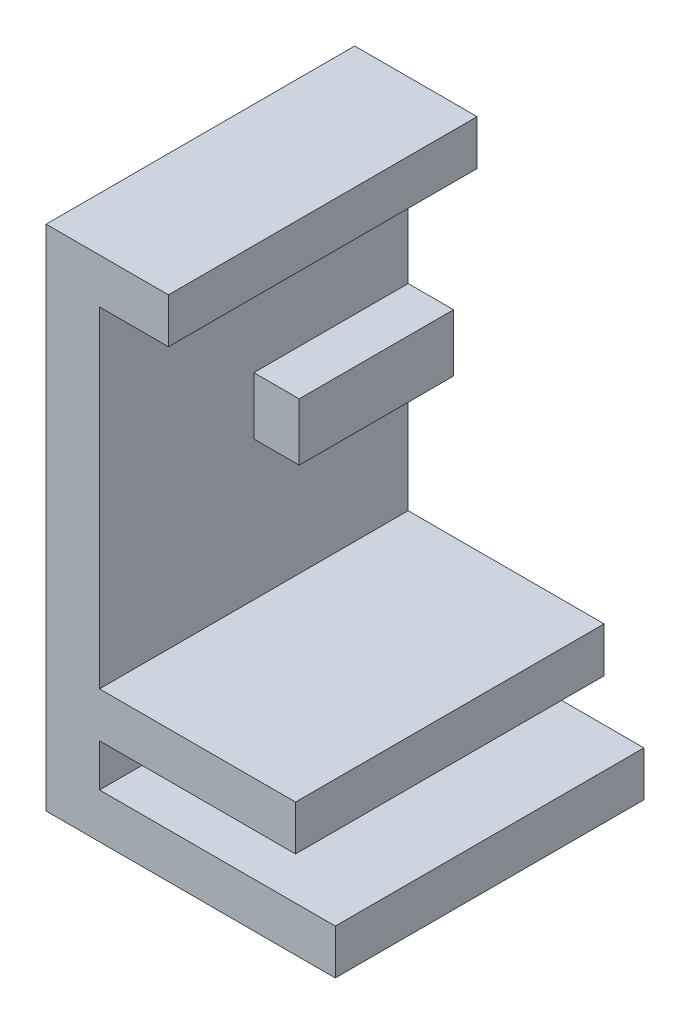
ISO-10303-21;
HEADER;
FILE_DESCRIPTION(('STEP AP214'),'2;1');
FILE_NAME('part.step','',(''),(''),'','','');
FILE_SCHEMA(('AUTOMOTIVE_DESIGN { 1 0 10303 214 1 1 1 1 }'));
ENDSEC;
DATA;
#1=APPLICATION_CONTEXT('core data for automotive mechanical design processes');
#2=APPLICATION_PROTOCOL_DEFINITION('international standard','automotive_design',2000,#1);
#3=PRODUCT_CONTEXT('',#1,'mechanical');
#4=PRODUCT('Part','Part','',(#3));
#5=PRODUCT_RELATED_PRODUCT_CATEGORY('part','',(#4));
#6=PRODUCT_DEFINITION_FORMATION('','',#4);
#7=PRODUCT_DEFINITION_CONTEXT('part definition',#1,'design');
#8=PRODUCT_DEFINITION('design','',#6,#7);
#9=PRODUCT_DEFINITION_SHAPE('','',#8);
#10=(LENGTH_UNIT() NAMED_UNIT(*) SI_UNIT(.MILLI.,.METRE.));
#11=(NAMED_UNIT(*) PLANE_ANGLE_UNIT() SI_UNIT($,.RADIAN.));
#12=(NAMED_UNIT(*) SI_UNIT($,.STERADIAN.) SOLID_ANGLE_UNIT());
#13=UNCERTAINTY_MEASURE_WITH_UNIT(LENGTH_MEASURE(1.E-05),#10,'distance_accuracy_value','');
#14=(GEOMETRIC_REPRESENTATION_CONTEXT(3) GLOBAL_UNCERTAINTY_ASSIGNED_CONTEXT((#13)) GLOBAL_UNIT_ASSIGNED_CONTEXT((#10,
#11,#12)) REPRESENTATION_CONTEXT('',''));
#15=CARTESIAN_POINT('',(0.,0.,0.));
#16=DIRECTION('',(0.,0.,1.));
#17=DIRECTION('',(1.,0.,0.));
#18=AXIS2_PLACEMENT_3D('',#15,#16,#17);
#19=CARTESIAN_POINT('',(139.766211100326,-45.7667519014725,47.5));
#20=DIRECTION('',(0.,-1.,0.));
#21=DIRECTION('',(0.,0.,-1.));
#22=AXIS2_PLACEMENT_3D('',#19,#20,#21);
#23=PLANE('',#22);
#24=DIRECTION('',(-1.,0.,0.));
#25=VECTOR('',#24,1.);
#26=CARTESIAN_POINT('',(139.766211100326,-45.7667519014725,-47.5));
#27=LINE('',#26,#25);
#28=CARTESIAN_POINT('',(139.766211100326,-45.7667519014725,-47.5));
#29=VERTEX_POINT('',#28);
#30=CARTESIAN_POINT('',(79.4274220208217,-45.7667519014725,-47.5));
#31=VERTEX_POINT('',#30);
#32=EDGE_CURVE('E160',#29,#31,#27,.T.);
#33=ORIENTED_EDGE('',*,*,#32,.T.);
#34=DIRECTION('',(0.,0.,-1.));
#35=VECTOR('',#34,1.);
#36=CARTESIAN_POINT('',(79.4274220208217,-45.7667519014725,47.5));
#37=LINE('',#36,#35);
#38=CARTESIAN_POINT('',(79.4274220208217,-45.7667519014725,47.5));
#39=VERTEX_POINT('',#38);
#40=EDGE_CURVE('E11',#39,#31,#37,.T.);
#41=ORIENTED_EDGE('',*,*,#40,.F.);
#42=DIRECTION('',(-1.,0.,0.));
#43=VECTOR('',#42,1.);
#44=CARTESIAN_POINT('',(139.766211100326,-45.7667519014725,47.5));
#45=LINE('',#44,#43);
#46=CARTESIAN_POINT('',(139.766211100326,-45.7667519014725,47.5));
#47=VERTEX_POINT('',#46);
#48=EDGE_CURVE('E224',#47,#39,#45,.T.);
#49=ORIENTED_EDGE('',*,*,#48,.F.);
#50=DIRECTION('',(0.,0.,-1.));
#51=VECTOR('',#50,1.);
#52=CARTESIAN_POINT('',(139.766211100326,-45.7667519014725,47.5));
#53=LINE('',#52,#51);
#54=EDGE_CURVE('E201',#47,#29,#53,.T.);
#55=ORIENTED_EDGE('',*,*,#54,.T.);
#56=EDGE_LOOP('',(#33,#41,#49,#55));
#57=FACE_BOUND('',#56,.T.);
#58=ADVANCED_FACE('F31',(#57),#23,.F.);
#59=CARTESIAN_POINT('',(79.4274220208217,-2.89157012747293,47.5));
#60=DIRECTION('',(0.,1.,0.));
#61=DIRECTION('',(0.,0.,1.));
#62=AXIS2_PLACEMENT_3D('',#59,#60,#61);
#63=PLANE('',#62);
#64=DIRECTION('',(0.,0.,-1.));
#65=VECTOR('',#64,1.);
#66=CARTESIAN_POINT('',(93.3999473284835,-2.89157012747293,47.5));
#67=LINE('',#66,#65);
#68=CARTESIAN_POINT('',(93.3999473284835,-2.89157012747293,0.));
#69=VERTEX_POINT('',#68);
#70=CARTESIAN_POINT('',(93.3999473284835,-2.89157012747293,-47.5));
#71=VERTEX_POINT('',#70);
#72=EDGE_CURVE('E159',#69,#71,#67,.T.);
#73=ORIENTED_EDGE('',*,*,#72,.F.);
#74=DIRECTION('',(1.,0.,0.));
#75=VECTOR('',#74,1.);
#76=CARTESIAN_POINT('',(79.4274220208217,-2.89157012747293,0.));
#77=LINE('',#76,#75);
#78=CARTESIAN_POINT('',(79.4274220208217,-2.89157012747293,0.));
#79=VERTEX_POINT('',#78);
#80=EDGE_CURVE('E145',#79,#69,#77,.T.);
#81=ORIENTED_EDGE('',*,*,#80,.F.);
#82=DIRECTION('',(0.,0.,-1.));
#83=VECTOR('',#82,1.);
#84=CARTESIAN_POINT('',(79.4274220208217,-2.89157012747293,47.5));
#85=LINE('',#84,#83);
#86=CARTESIAN_POINT('',(79.4274220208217,-2.89157012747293,-47.5));
#87=VERTEX_POINT('',#86);
#88=EDGE_CURVE('E38',#79,#87,#85,.T.);
#89=ORIENTED_EDGE('',*,*,#88,.T.);
#90=DIRECTION('',(1.,0.,0.));
#91=VECTOR('',#90,1.);
#92=CARTESIAN_POINT('',(79.4274220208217,-2.89157012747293,-47.5));
#93=LINE('',#92,#91);
#94=EDGE_CURVE('E254',#87,#71,#93,.T.);
#95=ORIENTED_EDGE('',*,*,#94,.T.);
#96=EDGE_LOOP('',(#73,#81,#89,#95));
#97=FACE_BOUND('',#96,.T.);
#98=ADVANCED_FACE('F156',(#97),#63,.F.);
#99=CARTESIAN_POINT('',(93.3999473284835,-2.89157012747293,47.5));
#100=DIRECTION('',(-1.,0.,0.));
#101=DIRECTION('',(0.,0.,1.));
#102=AXIS2_PLACEMENT_3D('',#99,#100,#101);
#103=PLANE('',#102);
#104=DIRECTION('',(0.,0.,-1.));
#105=VECTOR('',#104,1.);
#106=CARTESIAN_POINT('',(93.3999473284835,14.7914505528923,47.5));
#107=LINE('',#106,#105);
#108=CARTESIAN_POINT('',(93.3999473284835,14.7914505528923,0.));
#109=VERTEX_POINT('',#108);
#110=CARTESIAN_POINT('',(93.3999473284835,14.7914505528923,-47.5));
#111=VERTEX_POINT('',#110);
#112=EDGE_CURVE('E165',#109,#111,#107,.T.);
#113=ORIENTED_EDGE('',*,*,#112,.F.);
#114=DIRECTION('',(0.,1.,0.));
#115=VECTOR('',#114,1.);
#116=CARTESIAN_POINT('',(93.3999473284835,-86.5522105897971,0.));
#117=LINE('',#116,#115);
#118=EDGE_CURVE('E152',#69,#109,#117,.T.);
#119=ORIENTED_EDGE('',*,*,#118,.F.);
#120=ORIENTED_EDGE('',*,*,#72,.T.);
#121=DIRECTION('',(0.,1.,0.));
#122=VECTOR('',#121,1.);
#123=CARTESIAN_POINT('',(93.3999473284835,-2.89157012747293,-47.5));
#124=LINE('',#123,#122);
#125=EDGE_CURVE('E251',#71,#111,#124,.T.);
#126=ORIENTED_EDGE('',*,*,#125,.T.);
#127=EDGE_LOOP('',(#113,#119,#120,#126));
#128=FACE_BOUND('',#127,.T.);
#129=ADVANCED_FACE('F264',(#128),#103,.F.);
#130=CARTESIAN_POINT('',(93.3999473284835,14.7914505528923,47.5));
#131=DIRECTION('',(0.,-1.,0.));
#132=DIRECTION('',(0.,0.,-1.));
#133=AXIS2_PLACEMENT_3D('',#130,#131,#132);
#134=PLANE('',#133);
#135=DIRECTION('',(0.,0.,-1.));
#136=VECTOR('',#135,1.);
#137=CARTESIAN_POINT('',(79.4274220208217,14.7914505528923,47.5));
#138=LINE('',#137,#136);
#139=CARTESIAN_POINT('',(79.4274220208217,14.7914505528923,0.));
#140=VERTEX_POINT('',#139);
#141=CARTESIAN_POINT('',(79.4274220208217,14.7914505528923,-47.5));
#142=VERTEX_POINT('',#141);
#143=EDGE_CURVE('E169',#140,#142,#138,.T.);
#144=ORIENTED_EDGE('',*,*,#143,.F.);
#145=DIRECTION('',(-1.,0.,0.));
#146=VECTOR('',#145,1.);
#147=CARTESIAN_POINT('',(79.4274220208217,14.7914505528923,0.));
#148=LINE('',#147,#146);
#149=EDGE_CURVE('E148',#109,#140,#148,.T.);
#150=ORIENTED_EDGE('',*,*,#149,.F.);
#151=ORIENTED_EDGE('',*,*,#112,.T.);
#152=DIRECTION('',(-1.,0.,0.));
#153=VECTOR('',#152,1.);
#154=CARTESIAN_POINT('',(93.3999473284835,14.7914505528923,-47.5));
#155=LINE('',#154,#153);
#156=EDGE_CURVE('E248',#111,#142,#155,.T.);
#157=ORIENTED_EDGE('',*,*,#156,.T.);
#158=EDGE_LOOP('',(#144,#150,#151,#157));
#159=FACE_BOUND('',#158,.T.);
#160=ADVANCED_FACE('F263',(#159),#134,.F.);
#161=CARTESIAN_POINT('',(79.4274220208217,14.7914505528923,47.5));
#162=DIRECTION('',(-1.,0.,0.));
#163=DIRECTION('',(0.,0.,1.));
#164=AXIS2_PLACEMENT_3D('',#161,#162,#163);
#165=PLANE('',#164);
#166=DIRECTION('',(0.,1.,0.));
#167=VECTOR('',#166,1.);
#168=CARTESIAN_POINT('',(79.4274220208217,14.7914505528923,-47.5));
#169=LINE('',#168,#167);
#170=CARTESIAN_POINT('',(79.4274220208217,56.0485401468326,-47.5));
#171=VERTEX_POINT('',#170);
#172=EDGE_CURVE('E246',#142,#171,#169,.T.);
#173=ORIENTED_EDGE('',*,*,#172,.T.);
#174=DIRECTION('',(0.,0.,-1.));
#175=VECTOR('',#174,1.);
#176=CARTESIAN_POINT('',(79.4274220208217,56.0485401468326,47.5));
#177=LINE('',#176,#175);
#178=CARTESIAN_POINT('',(79.4274220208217,56.0485401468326,47.5));
#179=VERTEX_POINT('',#178);
#180=EDGE_CURVE('E171',#179,#171,#177,.T.);
#181=ORIENTED_EDGE('',*,*,#180,.F.);
#182=DIRECTION('',(0.,1.,0.));
#183=VECTOR('',#182,1.);
#184=CARTESIAN_POINT('',(79.4274220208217,-45.7667519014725,47.5));
#185=LINE('',#184,#183);
#186=EDGE_CURVE('E222',#39,#179,#185,.T.);
#187=ORIENTED_EDGE('',*,*,#186,.F.);
#188=ORIENTED_EDGE('',*,*,#40,.T.);
#189=DIRECTION('',(0.,1.,0.));
#190=VECTOR('',#189,1.);
#191=CARTESIAN_POINT('',(79.4274220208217,-45.7667519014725,-47.5));
#192=LINE('',#191,#190);
#193=EDGE_CURVE('E163',#31,#87,#192,.T.);
#194=ORIENTED_EDGE('',*,*,#193,.T.);
#195=ORIENTED_EDGE('',*,*,#88,.F.);
#196=DIRECTION('',(0.,1.,0.));
#197=VECTOR('',#196,1.);
#198=CARTESIAN_POINT('',(79.4274220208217,-86.5522105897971,0.));
#199=LINE('',#198,#197);
#200=EDGE_CURVE('E142',#79,#140,#199,.T.);
#201=ORIENTED_EDGE('',*,*,#200,.T.);
#202=ORIENTED_EDGE('',*,*,#143,.T.);
#203=EDGE_LOOP('',(#173,#181,#187,#188,#194,#195,#201,#202));
#204=FACE_BOUND('',#203,.T.);
#205=ADVANCED_FACE('F162',(#204),#165,.F.);
#206=CARTESIAN_POINT('',(79.4274220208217,56.0485401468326,47.5));
#207=DIRECTION('',(0.,1.,0.));
#208=DIRECTION('',(0.,0.,1.));
#209=AXIS2_PLACEMENT_3D('',#206,#207,#208);
#210=PLANE('',#209);
#211=DIRECTION('',(1.,0.,0.));
#212=VECTOR('',#211,1.);
#213=CARTESIAN_POINT('',(79.4274220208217,56.0485401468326,-47.5));
#214=LINE('',#213,#212);
#215=CARTESIAN_POINT('',(100.6545595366,56.0485401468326,-47.5));
#216=VERTEX_POINT('',#215);
#217=EDGE_CURVE('E244',#171,#216,#214,.T.);
#218=ORIENTED_EDGE('',*,*,#217,.T.);
#219=DIRECTION('',(0.,0.,-1.));
#220=VECTOR('',#219,1.);
#221=CARTESIAN_POINT('',(100.6545595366,56.0485401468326,47.5));
#222=LINE('',#221,#220);
#223=CARTESIAN_POINT('',(100.6545595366,56.0485401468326,47.5));
#224=VERTEX_POINT('',#223);
#225=EDGE_CURVE('E174',#224,#216,#222,.T.);
#226=ORIENTED_EDGE('',*,*,#225,.F.);
#227=DIRECTION('',(1.,0.,0.));
#228=VECTOR('',#227,1.);
#229=CARTESIAN_POINT('',(79.4274220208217,56.0485401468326,47.5));
#230=LINE('',#229,#228);
#231=EDGE_CURVE('E220',#179,#224,#230,.T.);
#232=ORIENTED_EDGE('',*,*,#231,.F.);
#233=ORIENTED_EDGE('',*,*,#180,.T.);
#234=EDGE_LOOP('',(#218,#226,#232,#233));
#235=FACE_BOUND('',#234,.T.);
#236=ADVANCED_FACE('F276',(#235),#210,.F.);
#237=CARTESIAN_POINT('',(100.6545595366,56.0485401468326,47.5));
#238=DIRECTION('',(-1.,0.,0.));
#239=DIRECTION('',(0.,0.,1.));
#240=AXIS2_PLACEMENT_3D('',#237,#238,#239);
#241=PLANE('',#240);
#242=DIRECTION('',(0.,1.,0.));
#243=VECTOR('',#242,1.);
#244=CARTESIAN_POINT('',(100.6545595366,56.0485401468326,-47.5));
#245=LINE('',#244,#243);
#246=CARTESIAN_POINT('',(100.6545595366,69.8894366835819,-47.5));
#247=VERTEX_POINT('',#246);
#248=EDGE_CURVE('E242',#216,#247,#245,.T.);
#249=ORIENTED_EDGE('',*,*,#248,.T.);
#250=DIRECTION('',(0.,0.,-1.));
#251=VECTOR('',#250,1.);
#252=CARTESIAN_POINT('',(100.6545595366,69.8894366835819,47.5));
#253=LINE('',#252,#251);
#254=CARTESIAN_POINT('',(100.6545595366,69.8894366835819,47.5));
#255=VERTEX_POINT('',#254);
#256=EDGE_CURVE('E177',#255,#247,#253,.T.);
#257=ORIENTED_EDGE('',*,*,#256,.F.);
#258=DIRECTION('',(0.,1.,0.));
#259=VECTOR('',#258,1.);
#260=CARTESIAN_POINT('',(100.6545595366,56.0485401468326,47.5));
#261=LINE('',#260,#259);
#262=EDGE_CURVE('E218',#224,#255,#261,.T.);
#263=ORIENTED_EDGE('',*,*,#262,.F.);
#264=ORIENTED_EDGE('',*,*,#225,.T.);
#265=EDGE_LOOP('',(#249,#257,#263,#264));
#266=FACE_BOUND('',#265,.T.);
#267=ADVANCED_FACE('F321',(#266),#241,.F.);
#268=CARTESIAN_POINT('',(62.9855483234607,69.8894366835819,47.5));
#269=DIRECTION('',(0.,-1.,0.));
#270=DIRECTION('',(1.,0.,0.));
#271=AXIS2_PLACEMENT_3D('',#268,#269,#270);
#272=PLANE('',#271);
#273=DIRECTION('',(-1.,0.,0.));
#274=VECTOR('',#273,1.);
#275=CARTESIAN_POINT('',(62.9855483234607,69.8894366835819,-47.5));
#276=LINE('',#275,#274);
#277=CARTESIAN_POINT('',(62.9855483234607,69.8894366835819,-47.5));
#278=VERTEX_POINT('',#277);
#279=EDGE_CURVE('E240',#247,#278,#276,.T.);
#280=ORIENTED_EDGE('',*,*,#279,.T.);
#281=DIRECTION('',(0.,0.,-1.));
#282=VECTOR('',#281,1.);
#283=CARTESIAN_POINT('',(62.9855483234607,69.8894366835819,47.5));
#284=LINE('',#283,#282);
#285=CARTESIAN_POINT('',(62.9855483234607,69.8894366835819,47.5));
#286=VERTEX_POINT('',#285);
#287=EDGE_CURVE('E180',#286,#278,#284,.T.);
#288=ORIENTED_EDGE('',*,*,#287,.F.);
#289=DIRECTION('',(-1.,0.,0.));
#290=VECTOR('',#289,1.);
#291=CARTESIAN_POINT('',(62.9855483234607,69.8894366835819,47.5));
#292=LINE('',#291,#290);
#293=EDGE_CURVE('E216',#255,#286,#292,.T.);
#294=ORIENTED_EDGE('',*,*,#293,.F.);
#295=ORIENTED_EDGE('',*,*,#256,.T.);
#296=EDGE_LOOP('',(#280,#288,#294,#295));
#297=FACE_BOUND('',#296,.T.);
#298=ADVANCED_FACE('F319',(#297),#272,.F.);
#299=CARTESIAN_POINT('',(62.9855483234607,-86.5512105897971,47.5));
#300=DIRECTION('',(1.,0.,0.));
#301=DIRECTION('',(0.,0.,-1.));
#302=AXIS2_PLACEMENT_3D('',#299,#300,#301);
#303=PLANE('',#302);
#304=DIRECTION('',(0.,-1.,0.));
#305=VECTOR('',#304,1.);
#306=CARTESIAN_POINT('',(62.9855483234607,-86.5512105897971,-47.5));
#307=LINE('',#306,#305);
#308=CARTESIAN_POINT('',(62.9855483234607,-86.5512105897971,-47.5));
#309=VERTEX_POINT('',#308);
#310=EDGE_CURVE('E238',#278,#309,#307,.T.);
#311=ORIENTED_EDGE('',*,*,#310,.T.);
#312=DIRECTION('',(0.,0.,-1.));
#313=VECTOR('',#312,1.);
#314=CARTESIAN_POINT('',(62.9855483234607,-86.5512105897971,47.5));
#315=LINE('',#314,#313);
#316=CARTESIAN_POINT('',(62.9855483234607,-86.5512105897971,47.5));
#317=VERTEX_POINT('',#316);
#318=EDGE_CURVE('E183',#317,#309,#315,.T.);
#319=ORIENTED_EDGE('',*,*,#318,.F.);
#320=DIRECTION('',(0.,-1.,0.));
#321=VECTOR('',#320,1.);
#322=CARTESIAN_POINT('',(62.9855483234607,-86.5512105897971,47.5));
#323=LINE('',#322,#321);
#324=EDGE_CURVE('E214',#286,#317,#323,.T.);
#325=ORIENTED_EDGE('',*,*,#324,.F.);
#326=ORIENTED_EDGE('',*,*,#287,.T.);
#327=EDGE_LOOP('',(#311,#319,#325,#326));
#328=FACE_BOUND('',#327,.T.);
#329=ADVANCED_FACE('F314',(#328),#303,.F.);
#330=CARTESIAN_POINT('',(152.004557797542,-86.5512105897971,47.5));
#331=DIRECTION('',(0.,1.,0.));
#332=DIRECTION('',(0.,0.,1.));
#333=AXIS2_PLACEMENT_3D('',#330,#331,#332);
#334=PLANE('',#333);
#335=DIRECTION('',(1.,0.,0.));
#336=VECTOR('',#335,1.);
#337=CARTESIAN_POINT('',(152.004557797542,-86.5512105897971,-47.5));
#338=LINE('',#337,#336);
#339=CARTESIAN_POINT('',(152.004557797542,-86.5512105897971,-47.5));
#340=VERTEX_POINT('',#339);
#341=EDGE_CURVE('E236',#309,#340,#338,.T.);
#342=ORIENTED_EDGE('',*,*,#341,.T.);
#343=DIRECTION('',(0.,0.,-1.));
#344=VECTOR('',#343,1.);
#345=CARTESIAN_POINT('',(152.004557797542,-86.5512105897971,47.5));
#346=LINE('',#345,#344);
#347=CARTESIAN_POINT('',(152.004557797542,-86.5512105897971,47.5));
#348=VERTEX_POINT('',#347);
#349=EDGE_CURVE('E186',#348,#340,#346,.T.);
#350=ORIENTED_EDGE('',*,*,#349,.F.);
#351=DIRECTION('',(1.,0.,0.));
#352=VECTOR('',#351,1.);
#353=CARTESIAN_POINT('',(152.004557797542,-86.5512105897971,47.5));
#354=LINE('',#353,#352);
#355=EDGE_CURVE('E212',#317,#348,#354,.T.);
#356=ORIENTED_EDGE('',*,*,#355,.F.);
#357=ORIENTED_EDGE('',*,*,#318,.T.);
#358=EDGE_LOOP('',(#342,#350,#356,#357));
#359=FACE_BOUND('',#358,.T.);
#360=ADVANCED_FACE('F309',(#359),#334,.F.);
#361=CARTESIAN_POINT('',(152.004557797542,-86.5512105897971,47.5));
#362=DIRECTION('',(-1.,0.,0.));
#363=DIRECTION('',(0.,0.,1.));
#364=AXIS2_PLACEMENT_3D('',#361,#362,#363);
#365=PLANE('',#364);
#366=DIRECTION('',(0.,1.,0.));
#367=VECTOR('',#366,1.);
#368=CARTESIAN_POINT('',(152.004557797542,-86.5512105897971,-47.5));
#369=LINE('',#368,#367);
#370=CARTESIAN_POINT('',(152.004557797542,-72.710314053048,-47.5));
#371=VERTEX_POINT('',#370);
#372=EDGE_CURVE('E234',#340,#371,#369,.T.);
#373=ORIENTED_EDGE('',*,*,#372,.T.);
#374=DIRECTION('',(0.,0.,-1.));
#375=VECTOR('',#374,1.);
#376=CARTESIAN_POINT('',(152.004557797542,-72.710314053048,47.5));
#377=LINE('',#376,#375);
#378=CARTESIAN_POINT('',(152.004557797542,-72.710314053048,47.5));
#379=VERTEX_POINT('',#378);
#380=EDGE_CURVE('E189',#379,#371,#377,.T.);
#381=ORIENTED_EDGE('',*,*,#380,.F.);
#382=DIRECTION('',(0.,1.,0.));
#383=VECTOR('',#382,1.);
#384=CARTESIAN_POINT('',(152.004557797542,-86.5512105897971,47.5));
#385=LINE('',#384,#383);
#386=EDGE_CURVE('E210',#348,#379,#385,.T.);
#387=ORIENTED_EDGE('',*,*,#386,.F.);
#388=ORIENTED_EDGE('',*,*,#349,.T.);
#389=EDGE_LOOP('',(#373,#381,#387,#388));
#390=FACE_BOUND('',#389,.T.);
#391=ADVANCED_FACE('F305',(#390),#365,.F.);
#392=CARTESIAN_POINT('',(152.004557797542,-72.710314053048,47.5));
#393=DIRECTION('',(0.,-1.,0.));
#394=DIRECTION('',(1.,0.,0.));
#395=AXIS2_PLACEMENT_3D('',#392,#393,#394);
#396=PLANE('',#395);
#397=DIRECTION('',(-1.,0.,0.));
#398=VECTOR('',#397,1.);
#399=CARTESIAN_POINT('',(152.004557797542,-72.710314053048,-47.5));
#400=LINE('',#399,#398);
#401=CARTESIAN_POINT('',(79.4274220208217,-72.7103140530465,-47.5));
#402=VERTEX_POINT('',#401);
#403=EDGE_CURVE('E232',#371,#402,#400,.T.);
#404=ORIENTED_EDGE('',*,*,#403,.T.);
#405=DIRECTION('',(0.,0.,-1.));
#406=VECTOR('',#405,1.);
#407=CARTESIAN_POINT('',(79.4274220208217,-72.7103140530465,47.5));
#408=LINE('',#407,#406);
#409=CARTESIAN_POINT('',(79.4274220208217,-72.7103140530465,47.5));
#410=VERTEX_POINT('',#409);
#411=EDGE_CURVE('E192',#410,#402,#408,.T.);
#412=ORIENTED_EDGE('',*,*,#411,.F.);
#413=DIRECTION('',(-1.,0.,0.));
#414=VECTOR('',#413,1.);
#415=CARTESIAN_POINT('',(152.004557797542,-72.710314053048,47.5));
#416=LINE('',#415,#414);
#417=EDGE_CURVE('E208',#379,#410,#416,.T.);
#418=ORIENTED_EDGE('',*,*,#417,.F.);
#419=ORIENTED_EDGE('',*,*,#380,.T.);
#420=EDGE_LOOP('',(#404,#412,#418,#419));
#421=FACE_BOUND('',#420,.T.);
#422=ADVANCED_FACE('F300',(#421),#396,.F.);
#423=CARTESIAN_POINT('',(79.4274220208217,-72.7103140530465,47.5));
#424=DIRECTION('',(-1.,0.,0.));
#425=DIRECTION('',(0.,0.,1.));
#426=AXIS2_PLACEMENT_3D('',#423,#424,#425);
#427=PLANE('',#426);
#428=DIRECTION('',(0.,1.,0.));
#429=VECTOR('',#428,1.);
#430=CARTESIAN_POINT('',(79.4274220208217,-72.7103140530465,-47.5));
#431=LINE('',#430,#429);
#432=CARTESIAN_POINT('',(79.4274220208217,-59.6076484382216,-47.5));
#433=VERTEX_POINT('',#432);
#434=EDGE_CURVE('E230',#402,#433,#431,.T.);
#435=ORIENTED_EDGE('',*,*,#434,.T.);
#436=DIRECTION('',(0.,0.,-1.));
#437=VECTOR('',#436,1.);
#438=CARTESIAN_POINT('',(79.4274220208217,-59.6076484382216,47.5));
#439=LINE('',#438,#437);
#440=CARTESIAN_POINT('',(79.4274220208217,-59.6076484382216,47.5));
#441=VERTEX_POINT('',#440);
#442=EDGE_CURVE('E195',#441,#433,#439,.T.);
#443=ORIENTED_EDGE('',*,*,#442,.F.);
#444=DIRECTION('',(0.,1.,0.));
#445=VECTOR('',#444,1.);
#446=CARTESIAN_POINT('',(79.4274220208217,-72.7103140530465,47.5));
#447=LINE('',#446,#445);
#448=EDGE_CURVE('E206',#410,#441,#447,.T.);
#449=ORIENTED_EDGE('',*,*,#448,.F.);
#450=ORIENTED_EDGE('',*,*,#411,.T.);
#451=EDGE_LOOP('',(#435,#443,#449,#450));
#452=FACE_BOUND('',#451,.T.);
#453=ADVANCED_FACE('F294',(#452),#427,.F.);
#454=CARTESIAN_POINT('',(79.4274220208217,-59.6076484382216,47.5));
#455=DIRECTION('',(0.,1.,0.));
#456=DIRECTION('',(0.,0.,1.));
#457=AXIS2_PLACEMENT_3D('',#454,#455,#456);
#458=PLANE('',#457);
#459=DIRECTION('',(1.,0.,0.));
#460=VECTOR('',#459,1.);
#461=CARTESIAN_POINT('',(79.4274220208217,-59.6076484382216,-47.5));
#462=LINE('',#461,#460);
#463=CARTESIAN_POINT('',(139.766211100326,-59.6076484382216,-47.5));
#464=VERTEX_POINT('',#463);
#465=EDGE_CURVE('E228',#433,#464,#462,.T.);
#466=ORIENTED_EDGE('',*,*,#465,.T.);
#467=DIRECTION('',(0.,0.,-1.));
#468=VECTOR('',#467,1.);
#469=CARTESIAN_POINT('',(139.766211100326,-59.6076484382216,47.5));
#470=LINE('',#469,#468);
#471=CARTESIAN_POINT('',(139.766211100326,-59.6076484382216,47.5));
#472=VERTEX_POINT('',#471);
#473=EDGE_CURVE('E198',#472,#464,#470,.T.);
#474=ORIENTED_EDGE('',*,*,#473,.F.);
#475=DIRECTION('',(1.,0.,0.));
#476=VECTOR('',#475,1.);
#477=CARTESIAN_POINT('',(79.4274220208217,-59.6076484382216,47.5));
#478=LINE('',#477,#476);
#479=EDGE_CURVE('E50',#441,#472,#478,.T.);
#480=ORIENTED_EDGE('',*,*,#479,.F.);
#481=ORIENTED_EDGE('',*,*,#442,.T.);
#482=EDGE_LOOP('',(#466,#474,#480,#481));
#483=FACE_BOUND('',#482,.T.);
#484=ADVANCED_FACE('F290',(#483),#458,.F.);
#485=CARTESIAN_POINT('',(139.766211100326,-59.6076484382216,47.5));
#486=DIRECTION('',(-1.,0.,0.));
#487=DIRECTION('',(0.,0.,1.));
#488=AXIS2_PLACEMENT_3D('',#485,#486,#487);
#489=PLANE('',#488);
#490=DIRECTION('',(0.,1.,0.));
#491=VECTOR('',#490,1.);
#492=CARTESIAN_POINT('',(139.766211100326,-59.6076484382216,-47.5));
#493=LINE('',#492,#491);
#494=EDGE_CURVE('E226',#464,#29,#493,.T.);
#495=ORIENTED_EDGE('',*,*,#494,.T.);
#496=ORIENTED_EDGE('',*,*,#54,.F.);
#497=DIRECTION('',(0.,1.,0.));
#498=VECTOR('',#497,1.);
#499=CARTESIAN_POINT('',(139.766211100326,-59.6076484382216,47.5));
#500=LINE('',#499,#498);
#501=EDGE_CURVE('E45',#472,#47,#500,.T.);
#502=ORIENTED_EDGE('',*,*,#501,.F.);
#503=ORIENTED_EDGE('',*,*,#473,.T.);
#504=EDGE_LOOP('',(#495,#496,#502,#503));
#505=FACE_BOUND('',#504,.T.);
#506=ADVANCED_FACE('F288',(#505),#489,.F.);
#507=CARTESIAN_POINT('',(79.4274220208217,-45.7667519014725,47.5));
#508=DIRECTION('',(0.,0.,-1.));
#509=DIRECTION('',(-1.,0.,0.));
#510=AXIS2_PLACEMENT_3D('',#507,#508,#509);
#511=PLANE('',#510);
#512=ORIENTED_EDGE('',*,*,#186,.T.);
#513=ORIENTED_EDGE('',*,*,#231,.T.);
#514=ORIENTED_EDGE('',*,*,#262,.T.);
#515=ORIENTED_EDGE('',*,*,#293,.T.);
#516=ORIENTED_EDGE('',*,*,#324,.T.);
#517=ORIENTED_EDGE('',*,*,#355,.T.);
#518=ORIENTED_EDGE('',*,*,#386,.T.);
#519=ORIENTED_EDGE('',*,*,#417,.T.);
#520=ORIENTED_EDGE('',*,*,#448,.T.);
#521=ORIENTED_EDGE('',*,*,#479,.T.);
#522=ORIENTED_EDGE('',*,*,#501,.T.);
#523=ORIENTED_EDGE('',*,*,#48,.T.);
#524=EDGE_LOOP('',(#512,#513,#514,#515,#516,#517,#518,#519,#520,#521,#522,#523));
#525=FACE_BOUND('',#524,.T.);
#526=ADVANCED_FACE('F279',(#525),#511,.F.);
#527=CARTESIAN_POINT('',(79.4274220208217,-45.7667519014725,-47.5));
#528=DIRECTION('',(0.,0.,-1.));
#529=DIRECTION('',(-1.,0.,0.));
#530=AXIS2_PLACEMENT_3D('',#527,#528,#529);
#531=PLANE('',#530);
#532=ORIENTED_EDGE('',*,*,#32,.F.);
#533=ORIENTED_EDGE('',*,*,#494,.F.);
#534=ORIENTED_EDGE('',*,*,#465,.F.);
#535=ORIENTED_EDGE('',*,*,#434,.F.);
#536=ORIENTED_EDGE('',*,*,#403,.F.);
#537=ORIENTED_EDGE('',*,*,#372,.F.);
#538=ORIENTED_EDGE('',*,*,#341,.F.);
#539=ORIENTED_EDGE('',*,*,#310,.F.);
#540=ORIENTED_EDGE('',*,*,#279,.F.);
#541=ORIENTED_EDGE('',*,*,#248,.F.);
#542=ORIENTED_EDGE('',*,*,#217,.F.);
#543=ORIENTED_EDGE('',*,*,#172,.F.);
#544=ORIENTED_EDGE('',*,*,#156,.F.);
#545=ORIENTED_EDGE('',*,*,#125,.F.);
#546=ORIENTED_EDGE('',*,*,#94,.F.);
#547=ORIENTED_EDGE('',*,*,#193,.F.);
#548=EDGE_LOOP('',(#532,#533,#534,#535,#536,#537,#538,#539,#540,#541,#542,#543,#544,#545,#546,#547));
#549=FACE_BOUND('',#548,.T.);
#550=ADVANCED_FACE('F270',(#549),#531,.T.);
#551=CARTESIAN_POINT('',(79.4274220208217,-86.5522105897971,0.));
#552=DIRECTION('',(0.,0.,-1.));
#553=DIRECTION('',(-1.,0.,0.));
#554=AXIS2_PLACEMENT_3D('',#551,#552,#553);
#555=PLANE('',#554);
#556=ORIENTED_EDGE('',*,*,#80,.T.);
#557=ORIENTED_EDGE('',*,*,#118,.T.);
#558=ORIENTED_EDGE('',*,*,#149,.T.);
#559=ORIENTED_EDGE('',*,*,#200,.F.);
#560=EDGE_LOOP('',(#556,#557,#558,#559));
#561=FACE_BOUND('',#560,.T.);
#562=ADVANCED_FACE('F144',(#561),#555,.F.);
#563=CLOSED_SHELL('',(#58,#98,#129,#160,#205,#236,#267,#298,#329,#360,#391,#422,#453,#484,#506,
#526,#550,#562));
#564=MANIFOLD_SOLID_BREP('B2',#563);
#565=ADVANCED_BREP_SHAPE_REPRESENTATION('',(#18,#564),#14);
#566=SHAPE_DEFINITION_REPRESENTATION(#9,#565);
ENDSEC;
END-ISO-10303-21;
